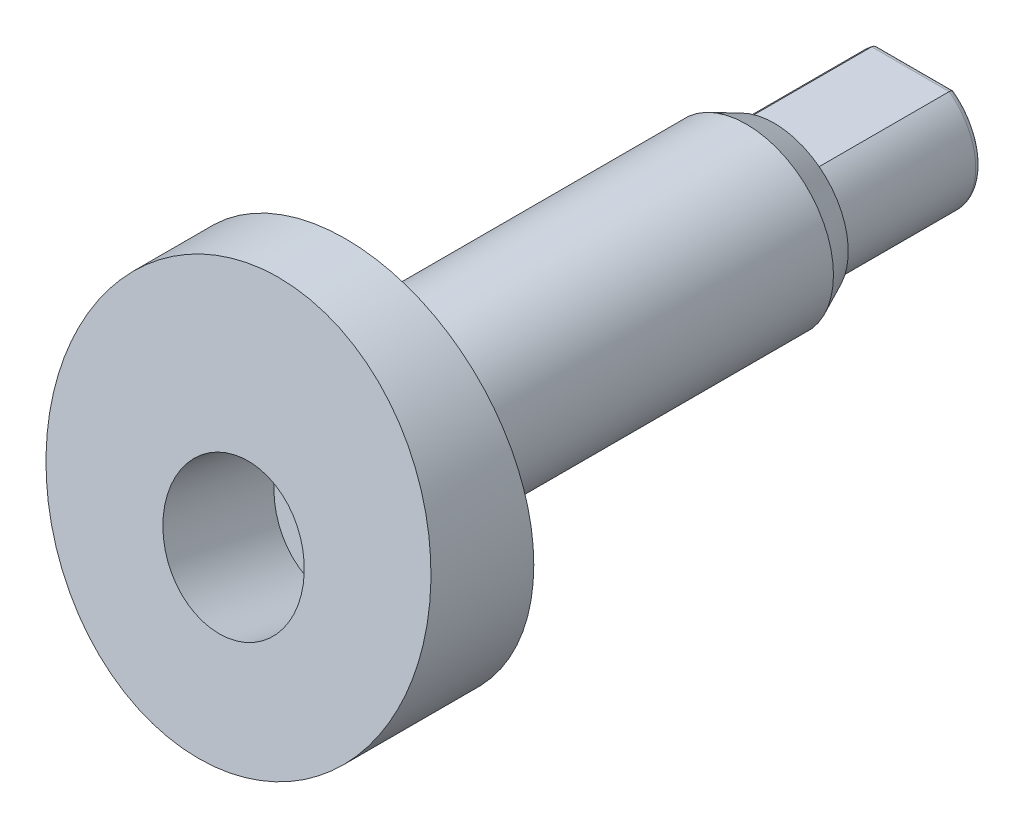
ISO-10303-21;
HEADER;
FILE_DESCRIPTION(('STEP AP214'),'2;1');
FILE_NAME('part.step','',(''),(''),'','','');
FILE_SCHEMA(('AUTOMOTIVE_DESIGN { 1 0 10303 214 1 1 1 1 }'));
ENDSEC;
DATA;
#1=APPLICATION_CONTEXT('core data for automotive mechanical design processes');
#2=APPLICATION_PROTOCOL_DEFINITION('international standard','automotive_design',2000,#1);
#3=PRODUCT_CONTEXT('',#1,'mechanical');
#4=PRODUCT('Part','Part','',(#3));
#5=PRODUCT_RELATED_PRODUCT_CATEGORY('part','',(#4));
#6=PRODUCT_DEFINITION_FORMATION('','',#4);
#7=PRODUCT_DEFINITION_CONTEXT('part definition',#1,'design');
#8=PRODUCT_DEFINITION('design','',#6,#7);
#9=PRODUCT_DEFINITION_SHAPE('','',#8);
#10=(LENGTH_UNIT() NAMED_UNIT(*) SI_UNIT(.MILLI.,.METRE.));
#11=(NAMED_UNIT(*) PLANE_ANGLE_UNIT() SI_UNIT($,.RADIAN.));
#12=(NAMED_UNIT(*) SI_UNIT($,.STERADIAN.) SOLID_ANGLE_UNIT());
#13=UNCERTAINTY_MEASURE_WITH_UNIT(LENGTH_MEASURE(1.E-05),#10,'distance_accuracy_value','');
#14=(GEOMETRIC_REPRESENTATION_CONTEXT(3) GLOBAL_UNCERTAINTY_ASSIGNED_CONTEXT((#13)) GLOBAL_UNIT_ASSIGNED_CONTEXT((#10,
#11,#12)) REPRESENTATION_CONTEXT('',''));
#15=CARTESIAN_POINT('',(0.,0.,0.));
#16=DIRECTION('',(0.,0.,1.));
#17=DIRECTION('',(1.,0.,0.));
#18=AXIS2_PLACEMENT_3D('',#15,#16,#17);
#19=CARTESIAN_POINT('',(0.,0.,-26.1619999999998));
#20=DIRECTION('',(0.,0.,1.));
#21=DIRECTION('',(1.,0.,0.));
#22=AXIS2_PLACEMENT_3D('',#19,#20,#21);
#23=CYLINDRICAL_SURFACE('',#22,3.99034);
#24=CARTESIAN_POINT('',(1.17961196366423E-13,0.,-18.3895999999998));
#25=DIRECTION('',(0.,0.,-1.));
#26=DIRECTION('',(-1.,0.,0.));
#27=AXIS2_PLACEMENT_3D('',#24,#25,#26);
#28=CIRCLE('',#27,3.99034);
#29=CARTESIAN_POINT('',(-3.99033999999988,0.,-18.3895999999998));
#30=VERTEX_POINT('',#29);
#31=EDGE_CURVE('E43',#30,#30,#28,.F.);
#32=ORIENTED_EDGE('',*,*,#31,.T.);
#33=EDGE_LOOP('',(#32));
#34=FACE_BOUND('',#33,.T.);
#35=CARTESIAN_POINT('',(0.,0.,-0.253999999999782));
#36=DIRECTION('',(0.,0.,1.));
#37=DIRECTION('',(1.,0.,0.));
#38=AXIS2_PLACEMENT_3D('',#35,#36,#37);
#39=CIRCLE('',#38,3.99034);
#40=CARTESIAN_POINT('',(3.99034,0.,-0.253999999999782));
#41=VERTEX_POINT('',#40);
#42=EDGE_CURVE('E12',#41,#41,#39,.T.);
#43=ORIENTED_EDGE('',*,*,#42,.F.);
#44=EDGE_LOOP('',(#43));
#45=FACE_BOUND('',#44,.T.);
#46=ADVANCED_FACE('F35',(#34,#45),#23,.T.);
#47=CARTESIAN_POINT('',(1.17961196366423E-13,0.,-19.6595999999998));
#48=DIRECTION('',(0.,0.,-1.));
#49=DIRECTION('',(-1.,0.,0.));
#50=AXIS2_PLACEMENT_3D('',#47,#48,#49);
#51=PLANE('',#50);
#52=CARTESIAN_POINT('',(1.17961196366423E-13,0.,-19.6595999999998));
#53=DIRECTION('',(0.,0.,-1.));
#54=DIRECTION('',(-1.,0.,0.));
#55=AXIS2_PLACEMENT_3D('',#52,#53,#54);
#56=CIRCLE('',#55,3.39812927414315);
#57=CARTESIAN_POINT('',(-3.39812927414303,0.,-19.6595999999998));
#58=VERTEX_POINT('',#57);
#59=EDGE_CURVE('E110',#58,#58,#56,.T.);
#60=ORIENTED_EDGE('',*,*,#59,.T.);
#61=EDGE_LOOP('',(#60));
#62=FACE_BOUND('',#61,.T.);
#63=CARTESIAN_POINT('',(1.17961196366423E-13,0.,-19.6595999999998));
#64=DIRECTION('',(0.,0.,-1.));
#65=DIRECTION('',(-1.,0.,0.));
#66=AXIS2_PLACEMENT_3D('',#63,#64,#65);
#67=CIRCLE('',#66,2.9972);
#68=CARTESIAN_POINT('',(1.77781856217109,2.41300000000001,-19.6595999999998));
#69=VERTEX_POINT('',#68);
#70=CARTESIAN_POINT('',(-1.77781856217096,2.41300000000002,-19.6595999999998));
#71=VERTEX_POINT('',#70);
#72=EDGE_CURVE('E75',#69,#71,#67,.T.);
#73=ORIENTED_EDGE('',*,*,#72,.F.);
#74=DIRECTION('',(1.,0.,0.));
#75=VECTOR('',#74,1.);
#76=CARTESIAN_POINT('',(0.,2.41300000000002,-19.6595999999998));
#77=LINE('',#76,#75);
#78=EDGE_CURVE('E83',#71,#69,#77,.T.);
#79=ORIENTED_EDGE('',*,*,#78,.F.);
#80=EDGE_LOOP('',(#73,#79));
#81=FACE_BOUND('',#80,.T.);
#82=ADVANCED_FACE('F82',(#62,#81),#51,.T.);
#83=CARTESIAN_POINT('',(0.,2.41300000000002,-19.6595999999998));
#84=DIRECTION('',(0.,1.,0.));
#85=DIRECTION('',(0.,0.,1.));
#86=AXIS2_PLACEMENT_3D('',#83,#84,#85);
#87=PLANE('',#86);
#88=DIRECTION('',(0.,0.,-1.));
#89=VECTOR('',#88,1.);
#90=CARTESIAN_POINT('',(1.77781856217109,2.41300000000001,-19.6595999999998));
#91=LINE('',#90,#89);
#92=CARTESIAN_POINT('',(1.77781856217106,2.413,-25.9079999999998));
#93=VERTEX_POINT('',#92);
#94=EDGE_CURVE('E72',#69,#93,#91,.T.);
#95=ORIENTED_EDGE('',*,*,#94,.T.);
#96=DIRECTION('',(1.,0.,0.));
#97=VECTOR('',#96,1.);
#98=CARTESIAN_POINT('',(-1.11022302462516E-13,2.41300000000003,-25.9079999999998));
#99=LINE('',#98,#97);
#100=CARTESIAN_POINT('',(-1.77781856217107,2.41300000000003,-25.9079999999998));
#101=VERTEX_POINT('',#100);
#102=EDGE_CURVE('E50',#93,#101,#99,.F.);
#103=ORIENTED_EDGE('',*,*,#102,.T.);
#104=DIRECTION('',(0.,0.,-1.));
#105=VECTOR('',#104,1.);
#106=CARTESIAN_POINT('',(-1.77781856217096,2.41300000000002,-19.6595999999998));
#107=LINE('',#106,#105);
#108=EDGE_CURVE('E78',#71,#101,#107,.T.);
#109=ORIENTED_EDGE('',*,*,#108,.F.);
#110=ORIENTED_EDGE('',*,*,#78,.T.);
#111=EDGE_LOOP('',(#95,#103,#109,#110));
#112=FACE_BOUND('',#111,.T.);
#113=ADVANCED_FACE('F85',(#112),#87,.T.);
#114=CARTESIAN_POINT('',(1.17961196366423E-13,0.,-19.6595999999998));
#115=DIRECTION('',(0.,0.,-1.));
#116=DIRECTION('',(-1.,0.,0.));
#117=AXIS2_PLACEMENT_3D('',#114,#115,#116);
#118=CYLINDRICAL_SURFACE('',#117,2.9972);
#119=ORIENTED_EDGE('',*,*,#108,.T.);
#120=CARTESIAN_POINT('',(0.,0.,-25.9079999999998));
#121=DIRECTION('',(0.,0.,-1.));
#122=DIRECTION('',(-1.,0.,0.));
#123=AXIS2_PLACEMENT_3D('',#120,#121,#122);
#124=CIRCLE('',#123,2.9972);
#125=EDGE_CURVE('E76',#101,#93,#124,.F.);
#126=ORIENTED_EDGE('',*,*,#125,.T.);
#127=ORIENTED_EDGE('',*,*,#94,.F.);
#128=ORIENTED_EDGE('',*,*,#72,.T.);
#129=EDGE_LOOP('',(#119,#126,#127,#128));
#130=FACE_BOUND('',#129,.T.);
#131=ADVANCED_FACE('F74',(#130),#118,.T.);
#132=CARTESIAN_POINT('',(0.,0.,-26.1619999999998));
#133=DIRECTION('',(0.,0.,-1.));
#134=DIRECTION('',(-1.,0.,0.));
#135=AXIS2_PLACEMENT_3D('',#132,#133,#134);
#136=PLANE('',#135);
#137=DIRECTION('',(1.,0.,0.));
#138=VECTOR('',#137,1.);
#139=CARTESIAN_POINT('',(-1.11022302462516E-13,2.15900000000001,-26.1619999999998));
#140=LINE('',#139,#138);
#141=CARTESIAN_POINT('',(-1.69229584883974,2.15900000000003,-26.1619999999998));
#142=VERTEX_POINT('',#141);
#143=CARTESIAN_POINT('',(1.69229584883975,2.15900000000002,-26.1619999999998));
#144=VERTEX_POINT('',#143);
#145=EDGE_CURVE('E103',#142,#144,#140,.T.);
#146=ORIENTED_EDGE('',*,*,#145,.T.);
#147=CARTESIAN_POINT('',(0.,0.,-26.1619999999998));
#148=DIRECTION('',(0.,0.,-1.));
#149=DIRECTION('',(-1.,0.,0.));
#150=AXIS2_PLACEMENT_3D('',#147,#148,#149);
#151=CIRCLE('',#150,2.7432);
#152=EDGE_CURVE('E105',#144,#142,#151,.T.);
#153=ORIENTED_EDGE('',*,*,#152,.T.);
#154=EDGE_LOOP('',(#146,#153));
#155=FACE_BOUND('',#154,.T.);
#156=ADVANCED_FACE('F135',(#155),#136,.T.);
#157=CARTESIAN_POINT('',(-1.11022302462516E-13,2.15900000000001,-25.9079999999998));
#158=DIRECTION('',(1.,0.,0.));
#159=DIRECTION('',(0.,0.,-1.));
#160=AXIS2_PLACEMENT_3D('',#157,#158,#159);
#161=CYLINDRICAL_SURFACE('',#160,0.254);
#162=CARTESIAN_POINT('',(-1.77781856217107,2.41300000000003,-25.9079999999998));
#163=CARTESIAN_POINT('',(-1.77782281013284,2.41301429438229,-25.9217679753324));
#164=CARTESIAN_POINT('',(-1.77745102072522,2.41188152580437,-25.9355283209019));
#165=CARTESIAN_POINT('',(-1.77598815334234,2.40743180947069,-25.9626236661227));
#166=CARTESIAN_POINT('',(-1.77489857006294,2.40411940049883,-25.9759594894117));
#167=CARTESIAN_POINT('',(-1.7720326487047,2.39541950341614,-26.0018560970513));
#168=CARTESIAN_POINT('',(-1.77025630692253,2.39003200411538,-26.0144168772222));
#169=CARTESIAN_POINT('',(-1.76607392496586,2.37737340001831,-26.0384349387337));
#170=CARTESIAN_POINT('',(-1.76366778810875,2.37010200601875,-26.0498920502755));
#171=CARTESIAN_POINT('',(-1.75824119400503,2.35374441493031,-26.0716447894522));
#172=CARTESIAN_POINT('',(-1.75520917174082,2.34462412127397,-26.0819118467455));
#173=CARTESIAN_POINT('',(-1.74864794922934,2.32494801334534,-26.1007774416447));
#174=CARTESIAN_POINT('',(-1.74511857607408,2.31439169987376,-26.1093753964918));
#175=CARTESIAN_POINT('',(-1.73747760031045,2.29161546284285,-26.1250935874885));
#176=CARTESIAN_POINT('',(-1.73334628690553,2.27934028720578,-26.1321240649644));
#177=CARTESIAN_POINT('',(-1.72474878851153,2.25389447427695,-26.1440259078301));
#178=CARTESIAN_POINT('',(-1.72028262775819,2.24072390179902,-26.1488974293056));
#179=CARTESIAN_POINT('',(-1.71212291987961,2.2167599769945,-26.1555872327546));
#180=CARTESIAN_POINT('',(-1.70847166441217,2.20606993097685,-26.1578383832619));
#181=CARTESIAN_POINT('',(-1.70109039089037,2.18453039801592,-26.1609470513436));
#182=CARTESIAN_POINT('',(-1.69736052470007,2.17368122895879,-26.161807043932));
#183=CARTESIAN_POINT('',(-1.69317851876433,2.16155739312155,-26.1619903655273));
#184=CARTESIAN_POINT('',(-1.69273723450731,2.16027859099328,-26.1620000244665));
#185=CARTESIAN_POINT('',(-1.69229584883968,2.15900000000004,-26.1619999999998));
#186=B_SPLINE_CURVE_WITH_KNOTS('',3,(#162,#163,#164,#165,#166,#167,#168,#169,#170,#171,#172,
#173,#174,#175,#176,#177,#178,#179,#180,#181,#182,#183,#184,#185),.UNSPECIFIED.,.F.,.F.,(4,2,2,
2,2,2,2,2,2,2,2,4),(0.,0.0412407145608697,0.0823958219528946,0.12355115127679,0.164712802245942,
0.206716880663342,0.248735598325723,0.292753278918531,0.336767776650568,0.371244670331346,
0.405660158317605,0.409718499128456),.UNSPECIFIED.);
#187=EDGE_CURVE('E87',#101,#142,#186,.T.);
#188=ORIENTED_EDGE('',*,*,#187,.F.);
#189=ORIENTED_EDGE('',*,*,#102,.F.);
#190=CARTESIAN_POINT('',(1.77781856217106,2.413,-25.9079999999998));
#191=CARTESIAN_POINT('',(1.77782281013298,2.41301429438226,-25.9217679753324));
#192=CARTESIAN_POINT('',(1.7774510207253,2.41188152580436,-25.9355283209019));
#193=CARTESIAN_POINT('',(1.77598815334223,2.4074318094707,-25.9626236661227));
#194=CARTESIAN_POINT('',(1.77489857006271,2.40411940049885,-25.9759594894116));
#195=CARTESIAN_POINT('',(1.77203264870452,2.39541950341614,-26.0018560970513));
#196=CARTESIAN_POINT('',(1.77025630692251,2.39003200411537,-26.0144168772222));
#197=CARTESIAN_POINT('',(1.76607392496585,2.37737340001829,-26.0384349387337));
#198=CARTESIAN_POINT('',(1.76366778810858,2.37010200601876,-26.0498920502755));
#199=CARTESIAN_POINT('',(1.75824119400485,2.35374441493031,-26.0716447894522));
#200=CARTESIAN_POINT('',(1.75520917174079,2.34462412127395,-26.0819118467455));
#201=CARTESIAN_POINT('',(1.74864794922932,2.32494801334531,-26.1007774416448));
#202=CARTESIAN_POINT('',(1.74511857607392,2.31439169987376,-26.1093753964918));
#203=CARTESIAN_POINT('',(1.73747760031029,2.29161546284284,-26.1250935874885));
#204=CARTESIAN_POINT('',(1.73334628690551,2.27934028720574,-26.1321240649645));
#205=CARTESIAN_POINT('',(1.7247487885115,2.25389447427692,-26.1440259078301));
#206=CARTESIAN_POINT('',(1.720282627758,2.24072390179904,-26.1488974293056));
#207=CARTESIAN_POINT('',(1.71212291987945,2.21675997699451,-26.1555872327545));
#208=CARTESIAN_POINT('',(1.70847166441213,2.20606993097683,-26.1578383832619));
#209=CARTESIAN_POINT('',(1.70109039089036,2.1845303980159,-26.1609470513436));
#210=CARTESIAN_POINT('',(1.69736052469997,2.17368122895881,-26.161807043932));
#211=CARTESIAN_POINT('',(1.69317851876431,2.16155739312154,-26.1619903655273));
#212=CARTESIAN_POINT('',(1.6927372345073,2.16027859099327,-26.1620000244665));
#213=CARTESIAN_POINT('',(1.69229584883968,2.15900000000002,-26.1619999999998));
#214=B_SPLINE_CURVE_WITH_KNOTS('',3,(#190,#191,#192,#193,#194,#195,#196,#197,#198,#199,#200,
#201,#202,#203,#204,#205,#206,#207,#208,#209,#210,#211,#212,#213),.UNSPECIFIED.,.F.,.F.,(4,2,2,
2,2,2,2,2,2,2,2,4),(0.,0.0412407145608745,0.0823958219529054,0.123551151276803,
0.164712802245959,0.206716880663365,0.248735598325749,0.292753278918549,0.336767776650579,
0.37124467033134,0.405660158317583,0.409718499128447),.UNSPECIFIED.);
#215=EDGE_CURVE('E58',#144,#93,#214,.F.);
#216=ORIENTED_EDGE('',*,*,#215,.F.);
#217=ORIENTED_EDGE('',*,*,#145,.F.);
#218=EDGE_LOOP('',(#188,#189,#216,#217));
#219=FACE_BOUND('',#218,.T.);
#220=ADVANCED_FACE('F137',(#219),#161,.T.);
#221=CARTESIAN_POINT('',(0.,0.,-25.9079999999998));
#222=DIRECTION('',(0.,0.,-1.));
#223=DIRECTION('',(-1.,0.,0.));
#224=AXIS2_PLACEMENT_3D('',#221,#222,#223);
#225=TOROIDAL_SURFACE('',#224,2.7432,0.254);
#226=ORIENTED_EDGE('',*,*,#215,.T.);
#227=ORIENTED_EDGE('',*,*,#125,.F.);
#228=ORIENTED_EDGE('',*,*,#187,.T.);
#229=ORIENTED_EDGE('',*,*,#152,.F.);
#230=EDGE_LOOP('',(#226,#227,#228,#229));
#231=FACE_BOUND('',#230,.T.);
#232=ADVANCED_FACE('F121',(#231),#225,.T.);
#233=CARTESIAN_POINT('',(1.17961196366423E-13,0.,-19.6595999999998));
#234=DIRECTION('',(0.,0.,1.));
#235=DIRECTION('',(1.,0.,0.));
#236=AXIS2_PLACEMENT_3D('',#233,#234,#235);
#237=CONICAL_SURFACE('',#236,3.39812927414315,0.436332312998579);
#238=ORIENTED_EDGE('',*,*,#31,.F.);
#239=EDGE_LOOP('',(#238));
#240=FACE_BOUND('',#239,.T.);
#241=ORIENTED_EDGE('',*,*,#59,.F.);
#242=EDGE_LOOP('',(#241));
#243=FACE_BOUND('',#242,.T.);
#244=ADVANCED_FACE('F117',(#240,#243),#237,.T.);
#245=CARTESIAN_POINT('',(0.,0.,-0.253999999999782));
#246=DIRECTION('',(0.,0.,-1.));
#247=DIRECTION('',(-1.,0.,0.));
#248=AXIS2_PLACEMENT_3D('',#245,#246,#247);
#249=TOROIDAL_SURFACE('',#248,4.24434,0.254);
#250=CARTESIAN_POINT('',(0.,0.,2.22044604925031E-13));
#251=DIRECTION('',(0.,0.,-1.));
#252=DIRECTION('',(-1.,0.,0.));
#253=AXIS2_PLACEMENT_3D('',#250,#251,#252);
#254=CIRCLE('',#253,4.24434);
#255=CARTESIAN_POINT('',(-4.24434,0.,2.22044604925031E-13));
#256=VERTEX_POINT('',#255);
#257=EDGE_CURVE('E154',#256,#256,#254,.T.);
#258=ORIENTED_EDGE('',*,*,#257,.T.);
#259=EDGE_LOOP('',(#258));
#260=FACE_BOUND('',#259,.T.);
#261=ORIENTED_EDGE('',*,*,#42,.T.);
#262=EDGE_LOOP('',(#261));
#263=FACE_BOUND('',#262,.T.);
#264=ADVANCED_FACE('F120',(#260,#263),#249,.F.);
#265=CARTESIAN_POINT('',(0.,-2.13850650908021,0.0392876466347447));
#266=DIRECTION('',(0.,0.207911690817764,0.978147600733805));
#267=DIRECTION('',(0.,-0.978147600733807,0.207911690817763));
#268=AXIS2_PLACEMENT_3D('',#265,#266,#267);
#269=PLANE('',#268);
#270=CARTESIAN_POINT('',(0.,-2.13850650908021,0.0392876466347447));
#271=DIRECTION('',(0.,0.207911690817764,0.978147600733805));
#272=DIRECTION('',(0.,-0.978147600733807,0.207911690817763));
#273=AXIS2_PLACEMENT_3D('',#270,#271,#272);
#274=CIRCLE('',#273,3.175);
#275=CARTESIAN_POINT('',(0.,-5.24412514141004,0.699407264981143));
#276=VERTEX_POINT('',#275);
#277=EDGE_CURVE('E161',#276,#276,#274,.T.);
#278=ORIENTED_EDGE('',*,*,#277,.T.);
#279=EDGE_LOOP('',(#278));
#280=FACE_BOUND('',#279,.T.);
#281=ADVANCED_FACE('F191',(#280),#269,.T.);
#282=CARTESIAN_POINT('',(0.,-2.13850650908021,0.0392876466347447));
#283=DIRECTION('',(0.,0.207911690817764,0.978147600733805));
#284=DIRECTION('',(0.,-0.978147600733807,0.207911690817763));
#285=AXIS2_PLACEMENT_3D('',#282,#283,#284);
#286=CYLINDRICAL_SURFACE('',#285,3.175);
#287=ORIENTED_EDGE('',*,*,#277,.F.);
#288=EDGE_LOOP('',(#287));
#289=FACE_BOUND('',#288,.T.);
#290=CARTESIAN_POINT('',(0.,-1.05591033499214,5.13250220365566));
#291=DIRECTION('',(0.,0.207911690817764,0.978147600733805));
#292=DIRECTION('',(0.,-0.978147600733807,0.207911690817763));
#293=AXIS2_PLACEMENT_3D('',#290,#291,#292);
#294=CIRCLE('',#293,3.175);
#295=CARTESIAN_POINT('',(0.,-4.16152896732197,5.79262182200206));
#296=VERTEX_POINT('',#295);
#297=EDGE_CURVE('E158',#296,#296,#294,.T.);
#298=ORIENTED_EDGE('',*,*,#297,.T.);
#299=EDGE_LOOP('',(#298));
#300=FACE_BOUND('',#299,.T.);
#301=ADVANCED_FACE('F142',(#289,#300),#286,.F.);
#302=CARTESIAN_POINT('',(-12.8293839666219,8.63600000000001,3.07242306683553));
#303=DIRECTION('',(0.,-0.207911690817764,-0.978147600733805));
#304=DIRECTION('',(0.,0.978147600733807,-0.207911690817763));
#305=AXIS2_PLACEMENT_3D('',#302,#303,#304);
#306=PLANE('',#305);
#307=ORIENTED_EDGE('',*,*,#297,.F.);
#308=EDGE_LOOP('',(#307));
#309=FACE_BOUND('',#308,.T.);
#310=CARTESIAN_POINT('',(0.,0.,4.90806153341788));
#311=DIRECTION('',(0.,-0.207911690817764,-0.978147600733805));
#312=DIRECTION('',(0.,0.978147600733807,-0.207911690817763));
#313=AXIS2_PLACEMENT_3D('',#310,#311,#312);
#314=ELLIPSE('',#313,8.8289333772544,8.636);
#315=CARTESIAN_POINT('',(0.,8.63600000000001,3.07242306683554));
#316=VERTEX_POINT('',#315);
#317=EDGE_CURVE('E96',#316,#316,#314,.T.);
#318=ORIENTED_EDGE('',*,*,#317,.F.);
#319=EDGE_LOOP('',(#318));
#320=FACE_BOUND('',#319,.T.);
#321=ADVANCED_FACE('F140',(#309,#320),#306,.F.);
#322=CARTESIAN_POINT('',(0.,0.,6.74370000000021));
#323=DIRECTION('',(0.,0.,-1.));
#324=DIRECTION('',(-1.,0.,0.));
#325=AXIS2_PLACEMENT_3D('',#322,#323,#324);
#326=CYLINDRICAL_SURFACE('',#325,8.636);
#327=ORIENTED_EDGE('',*,*,#317,.T.);
#328=EDGE_LOOP('',(#327));
#329=FACE_BOUND('',#328,.T.);
#330=CARTESIAN_POINT('',(0.,0.,2.22044604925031E-13));
#331=DIRECTION('',(0.,0.,1.));
#332=DIRECTION('',(1.,0.,0.));
#333=AXIS2_PLACEMENT_3D('',#330,#331,#332);
#334=CIRCLE('',#333,8.636);
#335=CARTESIAN_POINT('',(8.636,0.,2.22044604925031E-13));
#336=VERTEX_POINT('',#335);
#337=EDGE_CURVE('E100',#336,#336,#334,.T.);
#338=ORIENTED_EDGE('',*,*,#337,.T.);
#339=EDGE_LOOP('',(#338));
#340=FACE_BOUND('',#339,.T.);
#341=ADVANCED_FACE('F37',(#329,#340),#326,.T.);
#342=CARTESIAN_POINT('',(0.,0.,2.22044604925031E-13));
#343=DIRECTION('',(0.,0.,1.));
#344=DIRECTION('',(1.,0.,0.));
#345=AXIS2_PLACEMENT_3D('',#342,#343,#344);
#346=PLANE('',#345);
#347=ORIENTED_EDGE('',*,*,#257,.F.);
#348=EDGE_LOOP('',(#347));
#349=FACE_BOUND('',#348,.T.);
#350=ORIENTED_EDGE('',*,*,#337,.F.);
#351=EDGE_LOOP('',(#350));
#352=FACE_BOUND('',#351,.T.);
#353=ADVANCED_FACE('F144',(#349,#352),#346,.F.);
#354=CLOSED_SHELL('',(#46,#82,#113,#131,#156,#220,#232,#244,#264,#281,#301,#321,#341,#353));
#355=MANIFOLD_SOLID_BREP('B2',#354);
#356=ADVANCED_BREP_SHAPE_REPRESENTATION('',(#18,#355),#14);
#357=SHAPE_DEFINITION_REPRESENTATION(#9,#356);
ENDSEC;
END-ISO-10303-21;
